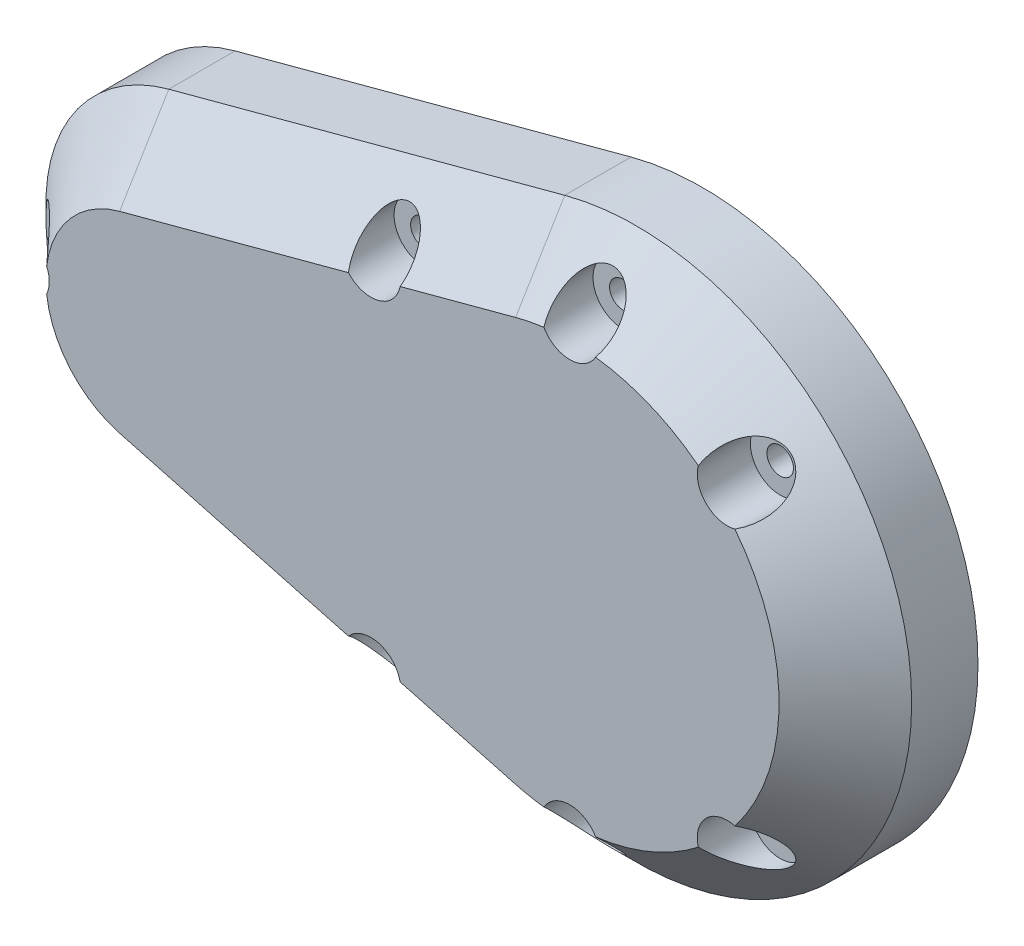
from build123d import *

# Parameters (mm, degrees)
BOSS_EXTRUDE1_DEPTH = 10
CHAMFER1_SIZE       = 5
SKETCH2_R           = 1
CUT_EXTRUDE1_DEPTH  = 41.178479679
SKETCH3_R           = 2.25
CUT_EXTRUDE2_DEPTH  = 4


with BuildPart() as part:
    # Sketch1 → Boss-Extrude1 (new body)
    with BuildSketch(Plane.XY):
        with BuildLine():
            Line((6.221168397, -20.074072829), (-23.635238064, -12.074072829))
            ThreePointArc((-23.635238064, -12.074072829), (-32.9, 0), (-23.635238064, 12.074072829))
            Line((-23.635238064, 12.074072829), (6.221168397, 20.074072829))
            ThreePointArc((6.221168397, 20.074072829), (32.382209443, 0), (6.221168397, -20.074072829))
        make_face()
    extrude(amount=BOSS_EXTRUDE1_DEPTH)

    # Chamfer1
    chamfer1_edges = [part.edges().sort_by_distance(p)[0] for p in [
        (-32.9, 0, 10),
        (-8.707034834, -16.074072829, 10),
        (32.382209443, 0, 10),
        (-8.707034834, 16.074072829, 10),
    ]]
    chamfer(chamfer1_edges, length=CHAMFER1_SIZE)

    # Sketch2 → Cut-Extrude1 (cut, through all)
    with BuildSketch(Plane(origin=(0, 0, 0), x_dir=(-1, 0, 0), z_dir=(0, 0, -1))):
        with Locations((3.4, -13.354983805)):
            Circle(SKETCH2_R)
        with Locations((29.9, 0)):
            Circle(SKETCH2_R)
        with Locations((-11.6, 16.782209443)):
            Circle(SKETCH2_R)
        with Locations((3.4, 13.354983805)):
            Circle(SKETCH2_R)
        with Locations((-23.466814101, 11.866814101)):
            Circle(SKETCH2_R)
        with Locations((-23.466814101, -11.866814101)):
            Circle(SKETCH2_R)
        with Locations((-11.6, -16.782209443)):
            Circle(SKETCH2_R)
    extrude(amount=-CUT_EXTRUDE1_DEPTH, mode=Mode.SUBTRACT)

    # Sketch3 → Cut-Extrude2 (cut)
    with BuildSketch(Plane.XY.offset(10)):
        with Locations((-3.4, -13.354983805)):
            Circle(SKETCH3_R)
        with Locations((11.6, -16.782209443)):
            Circle(SKETCH3_R)
        with Locations((23.466814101, -11.866814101)):
            Circle(SKETCH3_R)
        with Locations((23.466814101, 11.866814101)):
            Circle(SKETCH3_R)
        with Locations((-3.4, 13.354983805)):
            Circle(SKETCH3_R)
        with Locations((-29.9, 0)):
            Circle(SKETCH3_R)
        with Locations((11.6, 16.782209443)):
            Circle(SKETCH3_R)
    extrude(amount=-CUT_EXTRUDE2_DEPTH, mode=Mode.SUBTRACT)


solid = part.part
